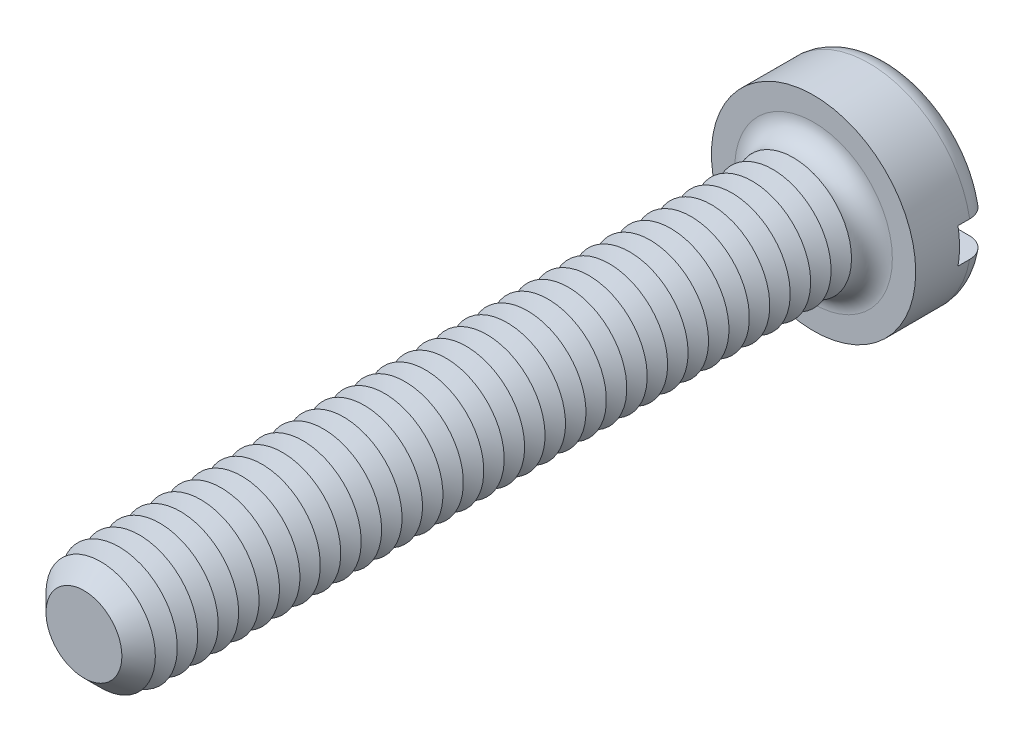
from build123d import *

# Parameters (mm, degrees)
SKETCH3_R           = 3.5
BOSS_EXTRUDE2_DEPTH = 2.6
SKETCH4_R           = 2
BOSS_EXTRUDE3_DEPTH = 25
FILLET1_R           = 0.7
CHAMFER1_SIZE       = 0.7
LPATTERN1_COUNT     = 34
LPATTERN1_PITCH     = 0.7
SKETCH8_W           = 7
SKETCH8_H           = 1.2
CUT_EXTRUDE1_DEPTH  = 1.1


with BuildPart() as part:
    # Sketch3 → Boss-Extrude2 (new body)
    with BuildSketch(Plane.XY):
        Circle(SKETCH3_R)
    extrude(amount=-BOSS_EXTRUDE2_DEPTH)

    # Sketch4 → Boss-Extrude3 (add)
    with BuildSketch(Plane.XY):
        Circle(SKETCH4_R)
    extrude(amount=BOSS_EXTRUDE3_DEPTH)

    # Fillet1
    fillet1_edges = [part.edges().sort_by_distance(p)[0] for p in [
        (-3.5, 0, -2.6),
        (-2, 0, 0),
    ]]
    fillet(fillet1_edges, radius=FILLET1_R)

    # Chamfer1
    chamfer1_edges = [part.edges().sort_by_distance(p)[0] for p in [
        (-2, 0, 25),
    ]]
    chamfer(chamfer1_edges, length=CHAMFER1_SIZE)

    # Sketch6 → Cut-Revolve1 (revolve, cut)
    with BuildSketch(Plane(origin=(0, 0, 0), x_dir=(0, 0, -1), z_dir=(1, 0, 0)), mode=Mode.PRIVATE) as cut_revolve1_sk:
        Polygon((-0.7, 2), (-1.05, 1.393782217), (-1.4, 2), align=None)
    cut_revolve1 = revolve(cut_revolve1_sk.sketch.rotate(Axis((0, 0, -1.694361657), (0, 0, 1)), 90), axis=Axis((0, 0, -1.694361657), (0, 0, 1)), mode=Mode.SUBTRACT)

    # LPattern1: Cut-Revolve1 ×34
    with Locations(*[(0, 0, i * LPATTERN1_PITCH) for i in range(1, LPATTERN1_COUNT)]):
        add(cut_revolve1, mode=Mode.SUBTRACT)

    # Sketch8 → Cut-Extrude1 (cut)
    with BuildSketch(Plane(origin=(0, 0, -2.6), x_dir=(-1, 0, 0), z_dir=(0, 0, -1))):
        Rectangle(SKETCH8_W, SKETCH8_H)
    extrude(amount=-CUT_EXTRUDE1_DEPTH, mode=Mode.SUBTRACT)


solid = part.part
